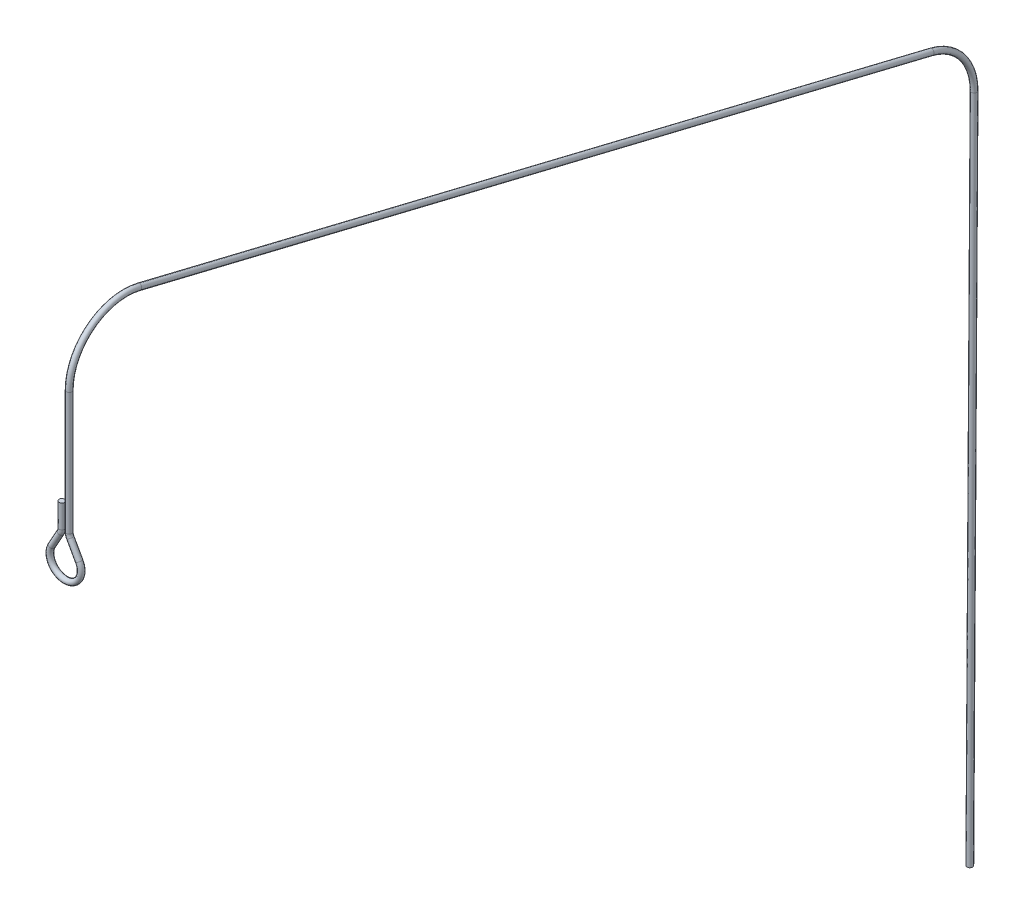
from build123d import *

# Parameters (mm, degrees)
ESQUISSE3_R = 2.5
ESQUISSE6_R = 2.5


with BuildPart() as part:
    # Balayage3: sweep along a path in Esquisse2
    with BuildLine(Plane(origin=(0, 0, 0), x_dir=(0, 0, -1), z_dir=(1, 0, 0))) as balayage3_path:
        Line((3.999106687, 1360.396425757), (7.81948441, 1960.396425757))
        ThreePointArc((7.81948441, 1960.396425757), (-2.874887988, 1991.795990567), (-30.742908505, 2009.78698008))
        Line((-30.742908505, 2009.78698008), (-741.475655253, 2182.680631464))
        ThreePointArc((-741.475655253, 2182.680631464), (-784.616825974, 2173.317081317), (-803.912238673, 2133.611619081))
        Line((-803.912238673, 2133.611619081), (-803.912238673, 2033.611619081))
    # Esquisse3 → Balayage3 (sweep)
    with BuildSketch(Plane(origin=(0, 2033.611619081, 0), x_dir=(-1, 0, 0), z_dir=(0, 1, 0))):
        with Locations((0, 803.912238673)):
            Circle(ESQUISSE3_R)
    sweep(path=balayage3_path.line)

    # Balayage4: sweep along a path in Esquisse5
    with BuildLine(Plane.XY.offset(803.912238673)) as balayage4_path:
        Line((0, 2033.611619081), (0, 2023.611619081))
        ThreePointArc((0, 2023.611619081), (0.257287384, 2021.59905819), (1.012600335, 2019.71594893))
        Line((1.012600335, 2019.71594893), (8.977949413, 2005.429041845))
        ThreePointArc((8.977949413, 2005.429041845), (-3.25, 1984.611619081), (-15.477949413, 2005.429041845))
        Line((-15.477949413, 2005.429041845), (-7.512600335, 2019.71594893))
        ThreePointArc((-7.512600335, 2019.71594893), (-6.757287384, 2021.59905819), (-6.5, 2023.611619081))
        Line((-6.5, 2023.611619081), (-6.5, 2044.437679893))
    # Esquisse6 → Balayage4 (sweep)
    with BuildSketch(Plane(origin=(0, 2033.611619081, 0), x_dir=(-1, 0, 0), z_dir=(0, 1, 0))):
        with Locations((0, 803.912238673)):
            Circle(ESQUISSE6_R)
    sweep(path=balayage4_path.line)


solid = part.part
